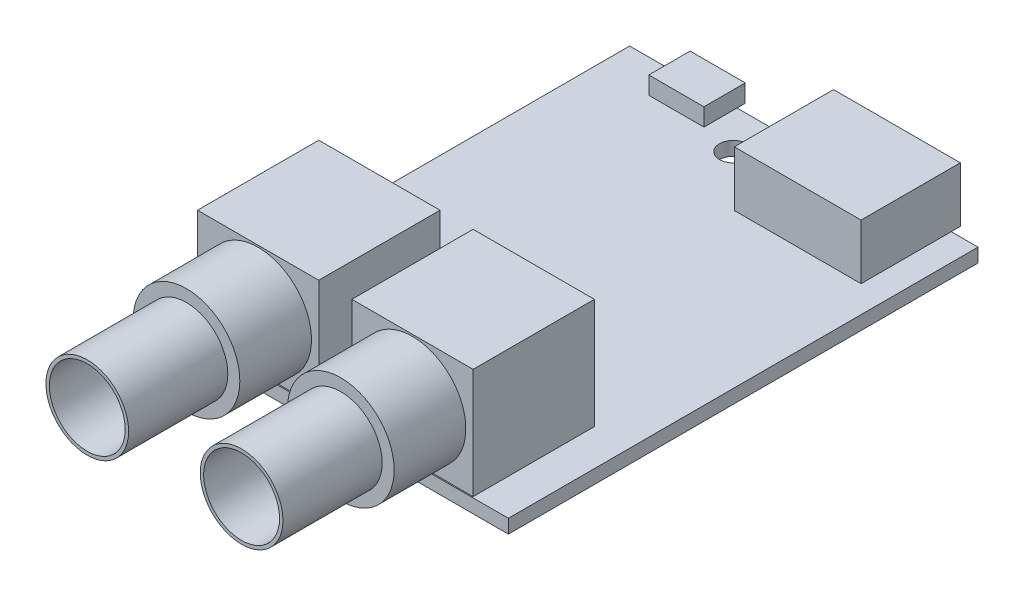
from build123d import *

# Parameters (mm, degrees)
SKETCH1_W           = 40.132
SKETCH1_H           = 54.102
BOSS_EXTRUDE1_DEPTH = 1.5875
CUT_EXTRUDE1_REACH  = 35.718
SKETCH2_R           = 1.5875
SKETCH3_W           = 6.35
SKETCH3_H           = 4.7625
BOSS_EXTRUDE2_DEPTH = 2.032
SKETCH4_W           = 14.605
SKETCH4_H           = 11.43
BOSS_EXTRUDE3_DEPTH = 6.35
SKETCH5_W           = 13.97
SKETCH5_H           = 13.97
BOSS_EXTRUDE4_DEPTH = 12.7
SKETCH6_R           = 6.1468
BOSS_EXTRUDE5_DEPTH = 8.255
SKETCH7_R           = 4.7625
BOSS_EXTRUDE6_DEPTH = 11.43
SKETCH8_R           = 4.371016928
CUT_EXTRUDE2_DEPTH  = 12.7
SKETCH9_R           = 1.117279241
BOSS_EXTRUDE7_DEPTH = 5.08
SKETCH10_R          = 0.390300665
CUT_EXTRUDE3_DEPTH  = 5.08
LPATTERN1_COUNT     = 2
LPATTERN1_PITCH     = 17.78
SKETCH11_W          = 1.941197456
SKETCH11_H          = 4.009168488
SKETCH11_W_2        = 4.009168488
SKETCH11_H_2        = 1.941197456
BOSS_EXTRUDE8_DEPTH = 2.54


with BuildPart() as part:
    # Sketch1 → Boss-Extrude1 (new body)
    with BuildSketch(Plane(origin=(0, 0, 0), x_dir=(1, 0, 0), z_dir=(0, 1, 0))):
        Rectangle(SKETCH1_W, SKETCH1_H)
    extrude(amount=BOSS_EXTRUDE1_DEPTH)

    # Sketch2 → Cut-Extrude1 (cut, up to next)
    with BuildSketch(Plane(origin=(0, 1.5875, 0), x_dir=(1, 0, 0), z_dir=(0, 1, 0)), mode=Mode.PRIVATE) as cut_extrude1_sk1:
        with Locations(Location((-3.556, 22.479, 0), (0, 0, 270))):
            Circle(SKETCH2_R)
    cut_extrude1_tool1 = extrude(cut_extrude1_sk1.sketch, amount=-CUT_EXTRUDE1_REACH, mode=Mode.PRIVATE) & part.part
    # Sketch2 → Cut-Extrude1 (cut, up to next)
    with BuildSketch(Plane(origin=(0, 1.5875, 0), x_dir=(1, 0, 0), z_dir=(0, 1, 0)), mode=Mode.PRIVATE) as cut_extrude1_sk2:
        with Locations(Location((-0.381, -9.271, 0), (0, 0, 270))):
            Circle(SKETCH2_R)
    cut_extrude1_tool2 = extrude(cut_extrude1_sk2.sketch, amount=-CUT_EXTRUDE1_REACH, mode=Mode.PRIVATE) & part.part
    add(cut_extrude1_tool1.solids().sort_by_distance((-3.556, 1.5875, -22.479))[0], mode=Mode.SUBTRACT)
    add(cut_extrude1_tool2.solids().sort_by_distance((-0.381, 1.5875, 9.271))[0], mode=Mode.SUBTRACT)

    # Sketch3 → Boss-Extrude2 (add)
    with BuildSketch(Plane(origin=(0, 1.5875, 0), x_dir=(1, 0, 0), z_dir=(0, 1, 0))):
        with Locations((-10.869846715, 25.616410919)):
            Rectangle(SKETCH3_W, SKETCH3_H)
    extrude(amount=BOSS_EXTRUDE2_DEPTH)

    # Sketch4 → Boss-Extrude3 (add)
    with BuildSketch(Plane(origin=(0, 1.5875, 0), x_dir=(1, 0, 0), z_dir=(0, 1, 0))):
        with Locations((9.679206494, 22.382638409)):
            Rectangle(SKETCH4_W, SKETCH4_H)
    extrude(amount=BOSS_EXTRUDE3_DEPTH)

    # Sketch5 → Boss-Extrude4 (add)
    with BuildSketch(Plane(origin=(0, 1.5875, 0), x_dir=(1, 0, 0), z_dir=(0, 1, 0))):
        with Locations((-8.89, -19.939)):
            Rectangle(SKETCH5_W, SKETCH5_H)
    boss_extrude4 = extrude(amount=BOSS_EXTRUDE4_DEPTH)

    # Sketch6 → Boss-Extrude5 (add)
    with BuildSketch(Plane.XY.offset(26.924)):
        with Locations(Location((-8.89, 7.9375, 0), (0, 0, 180))):
            Circle(SKETCH6_R)
    boss_extrude5 = extrude(amount=BOSS_EXTRUDE5_DEPTH)

    # Sketch7 → Boss-Extrude6 (add)
    with BuildSketch(Plane.XY.offset(35.179)):
        with Locations((-8.89, 7.9375)):
            Circle(SKETCH7_R)
    boss_extrude6 = extrude(amount=BOSS_EXTRUDE6_DEPTH)

    # Sketch8 → Cut-Extrude2 (cut)
    with BuildSketch(Plane.XY.offset(46.609)):
        with Locations((-8.89, 7.9375)):
            Circle(SKETCH8_R)
    cut_extrude2 = extrude(amount=-CUT_EXTRUDE2_DEPTH, mode=Mode.SUBTRACT)

    # Sketch9 → Boss-Extrude7 (add)
    with BuildSketch(Plane.XY.offset(33.909)):
        with Locations((-8.89, 7.9375)):
            Circle(SKETCH9_R)
    boss_extrude7 = extrude(amount=BOSS_EXTRUDE7_DEPTH)

    # Sketch10 → Cut-Extrude3 (cut)
    with BuildSketch(Plane.XY.offset(38.989)):
        with Locations((-8.89, 7.9375)):
            Circle(SKETCH10_R)
    cut_extrude3 = extrude(amount=-CUT_EXTRUDE3_DEPTH, mode=Mode.SUBTRACT)

    # LPattern1: Boss-Extrude4, Boss-Extrude5, Boss-Extrude6, Cut-Extrude2, Boss-Extrude7, Cut-Extrude3 ×2
    with Locations(*[(i * LPATTERN1_PITCH, 0, 0) for i in range(1, LPATTERN1_COUNT)]):
        add(boss_extrude4)
        add(boss_extrude5)
        add(boss_extrude6)
        add(cut_extrude2, mode=Mode.SUBTRACT)
        add(boss_extrude7)
        add(cut_extrude3, mode=Mode.SUBTRACT)

    # Sketch11 → Boss-Extrude8 (add)
    with BuildSketch(Plane.XZ):
        with Locations((-16.945036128, 7.701403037)):
            Rectangle(SKETCH11_W, SKETCH11_H)
        with Locations((10.878794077, -2.004584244)):
            Rectangle(SKETCH11_W, SKETCH11_H)
        with Locations((14.76118899, -2.004584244)):
            Rectangle(SKETCH11_W, SKETCH11_H)
        with Locations((13.952356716, 4.466073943)):
            Rectangle(SKETCH11_W, SKETCH11_H)
        with Locations((8.515684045, -22.935843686)):
            Rectangle(SKETCH11_W_2, SKETCH11_H_2)
    extrude(amount=BOSS_EXTRUDE8_DEPTH)


solid = part.part
